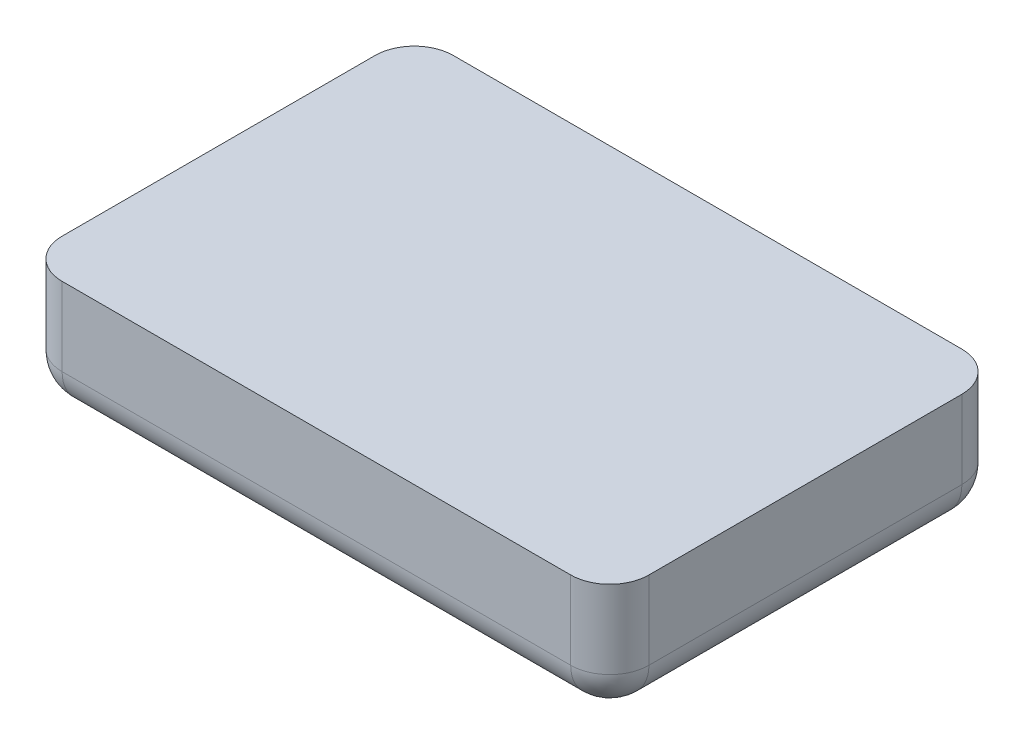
ISO-10303-21;
HEADER;
FILE_DESCRIPTION(('STEP AP214'),'2;1');
FILE_NAME('part.step','',(''),(''),'','','');
FILE_SCHEMA(('AUTOMOTIVE_DESIGN { 1 0 10303 214 1 1 1 1 }'));
ENDSEC;
DATA;
#1=APPLICATION_CONTEXT('core data for automotive mechanical design processes');
#2=APPLICATION_PROTOCOL_DEFINITION('international standard','automotive_design',2000,#1);
#3=PRODUCT_CONTEXT('',#1,'mechanical');
#4=PRODUCT('Part','Part','',(#3));
#5=PRODUCT_RELATED_PRODUCT_CATEGORY('part','',(#4));
#6=PRODUCT_DEFINITION_FORMATION('','',#4);
#7=PRODUCT_DEFINITION_CONTEXT('part definition',#1,'design');
#8=PRODUCT_DEFINITION('design','',#6,#7);
#9=PRODUCT_DEFINITION_SHAPE('','',#8);
#10=(LENGTH_UNIT() NAMED_UNIT(*) SI_UNIT(.MILLI.,.METRE.));
#11=(NAMED_UNIT(*) PLANE_ANGLE_UNIT() SI_UNIT($,.RADIAN.));
#12=(NAMED_UNIT(*) SI_UNIT($,.STERADIAN.) SOLID_ANGLE_UNIT());
#13=UNCERTAINTY_MEASURE_WITH_UNIT(LENGTH_MEASURE(1.E-05),#10,'distance_accuracy_value','');
#14=(GEOMETRIC_REPRESENTATION_CONTEXT(3) GLOBAL_UNCERTAINTY_ASSIGNED_CONTEXT((#13)) GLOBAL_UNIT_ASSIGNED_CONTEXT((#10,
#11,#12)) REPRESENTATION_CONTEXT('',''));
#15=CARTESIAN_POINT('',(0.,0.,0.));
#16=DIRECTION('',(0.,0.,1.));
#17=DIRECTION('',(1.,0.,0.));
#18=AXIS2_PLACEMENT_3D('',#15,#16,#17);
#19=CARTESIAN_POINT('',(-75.,30.,-50.));
#20=DIRECTION('',(1.,0.,0.));
#21=DIRECTION('',(0.,0.,-1.));
#22=AXIS2_PLACEMENT_3D('',#19,#20,#21);
#23=PLANE('',#22);
#24=DIRECTION('',(0.,0.,1.));
#25=VECTOR('',#24,1.);
#26=CARTESIAN_POINT('',(-75.,30.,-50.));
#27=LINE('',#26,#25);
#28=CARTESIAN_POINT('',(-75.,30.,-40.));
#29=VERTEX_POINT('',#28);
#30=CARTESIAN_POINT('',(-75.,30.,40.));
#31=VERTEX_POINT('',#30);
#32=EDGE_CURVE('E118',#29,#31,#27,.T.);
#33=ORIENTED_EDGE('',*,*,#32,.F.);
#34=DIRECTION('',(0.,-1.,0.));
#35=VECTOR('',#34,1.);
#36=CARTESIAN_POINT('',(-75.,30.,-40.));
#37=LINE('',#36,#35);
#38=CARTESIAN_POINT('',(-75.,10.,-40.));
#39=VERTEX_POINT('',#38);
#40=EDGE_CURVE('E51',#29,#39,#37,.T.);
#41=ORIENTED_EDGE('',*,*,#40,.T.);
#42=DIRECTION('',(0.,0.,1.));
#43=VECTOR('',#42,1.);
#44=CARTESIAN_POINT('',(-75.,10.,-50.));
#45=LINE('',#44,#43);
#46=CARTESIAN_POINT('',(-75.,10.,40.));
#47=VERTEX_POINT('',#46);
#48=EDGE_CURVE('E56',#39,#47,#45,.T.);
#49=ORIENTED_EDGE('',*,*,#48,.T.);
#50=DIRECTION('',(0.,-1.,0.));
#51=VECTOR('',#50,1.);
#52=CARTESIAN_POINT('',(-75.,30.,40.));
#53=LINE('',#52,#51);
#54=EDGE_CURVE('E162',#47,#31,#53,.F.);
#55=ORIENTED_EDGE('',*,*,#54,.T.);
#56=EDGE_LOOP('',(#33,#41,#49,#55));
#57=FACE_BOUND('',#56,.T.);
#58=ADVANCED_FACE('F34',(#57),#23,.F.);
#59=CARTESIAN_POINT('',(-75.,30.,50.));
#60=DIRECTION('',(0.,0.,-1.));
#61=DIRECTION('',(-1.,0.,0.));
#62=AXIS2_PLACEMENT_3D('',#59,#60,#61);
#63=PLANE('',#62);
#64=DIRECTION('',(1.,0.,0.));
#65=VECTOR('',#64,1.);
#66=CARTESIAN_POINT('',(-75.,30.,50.));
#67=LINE('',#66,#65);
#68=CARTESIAN_POINT('',(-65.,30.,50.));
#69=VERTEX_POINT('',#68);
#70=CARTESIAN_POINT('',(65.,30.,50.));
#71=VERTEX_POINT('',#70);
#72=EDGE_CURVE('E116',#69,#71,#67,.T.);
#73=ORIENTED_EDGE('',*,*,#72,.F.);
#74=DIRECTION('',(0.,-1.,0.));
#75=VECTOR('',#74,1.);
#76=CARTESIAN_POINT('',(-65.,30.,50.));
#77=LINE('',#76,#75);
#78=CARTESIAN_POINT('',(-65.,10.,50.));
#79=VERTEX_POINT('',#78);
#80=EDGE_CURVE('E126',#69,#79,#77,.T.);
#81=ORIENTED_EDGE('',*,*,#80,.T.);
#82=DIRECTION('',(1.,0.,0.));
#83=VECTOR('',#82,1.);
#84=CARTESIAN_POINT('',(-75.,10.,50.));
#85=LINE('',#84,#83);
#86=CARTESIAN_POINT('',(65.,10.,50.));
#87=VERTEX_POINT('',#86);
#88=EDGE_CURVE('E137',#79,#87,#85,.T.);
#89=ORIENTED_EDGE('',*,*,#88,.T.);
#90=DIRECTION('',(0.,-1.,0.));
#91=VECTOR('',#90,1.);
#92=CARTESIAN_POINT('',(65.,30.,50.));
#93=LINE('',#92,#91);
#94=EDGE_CURVE('E129',#87,#71,#93,.F.);
#95=ORIENTED_EDGE('',*,*,#94,.T.);
#96=EDGE_LOOP('',(#73,#81,#89,#95));
#97=FACE_BOUND('',#96,.T.);
#98=ADVANCED_FACE('F124',(#97),#63,.F.);
#99=CARTESIAN_POINT('',(75.,30.,-50.));
#100=DIRECTION('',(-1.,0.,0.));
#101=DIRECTION('',(0.,0.,1.));
#102=AXIS2_PLACEMENT_3D('',#99,#100,#101);
#103=PLANE('',#102);
#104=DIRECTION('',(0.,0.,-1.));
#105=VECTOR('',#104,1.);
#106=CARTESIAN_POINT('',(75.,10.,-50.));
#107=LINE('',#106,#105);
#108=CARTESIAN_POINT('',(75.,10.,40.));
#109=VERTEX_POINT('',#108);
#110=CARTESIAN_POINT('',(75.,10.,-40.));
#111=VERTEX_POINT('',#110);
#112=EDGE_CURVE('E152',#109,#111,#107,.T.);
#113=ORIENTED_EDGE('',*,*,#112,.T.);
#114=DIRECTION('',(0.,-1.,0.));
#115=VECTOR('',#114,1.);
#116=CARTESIAN_POINT('',(75.,30.,-40.));
#117=LINE('',#116,#115);
#118=CARTESIAN_POINT('',(75.,30.,-40.));
#119=VERTEX_POINT('',#118);
#120=EDGE_CURVE('E154',#111,#119,#117,.F.);
#121=ORIENTED_EDGE('',*,*,#120,.T.);
#122=DIRECTION('',(0.,0.,-1.));
#123=VECTOR('',#122,1.);
#124=CARTESIAN_POINT('',(75.,30.,-50.));
#125=LINE('',#124,#123);
#126=CARTESIAN_POINT('',(75.,30.,40.));
#127=VERTEX_POINT('',#126);
#128=EDGE_CURVE('E130',#127,#119,#125,.T.);
#129=ORIENTED_EDGE('',*,*,#128,.F.);
#130=DIRECTION('',(0.,-1.,0.));
#131=VECTOR('',#130,1.);
#132=CARTESIAN_POINT('',(75.,30.,40.));
#133=LINE('',#132,#131);
#134=EDGE_CURVE('E150',#127,#109,#133,.T.);
#135=ORIENTED_EDGE('',*,*,#134,.T.);
#136=EDGE_LOOP('',(#113,#121,#129,#135));
#137=FACE_BOUND('',#136,.T.);
#138=ADVANCED_FACE('F233',(#137),#103,.F.);
#139=CARTESIAN_POINT('',(-75.,30.,-50.));
#140=DIRECTION('',(0.,0.,1.));
#141=DIRECTION('',(1.,0.,0.));
#142=AXIS2_PLACEMENT_3D('',#139,#140,#141);
#143=PLANE('',#142);
#144=DIRECTION('',(-1.,0.,0.));
#145=VECTOR('',#144,1.);
#146=CARTESIAN_POINT('',(-75.,10.,-50.));
#147=LINE('',#146,#145);
#148=CARTESIAN_POINT('',(65.,10.,-50.));
#149=VERTEX_POINT('',#148);
#150=CARTESIAN_POINT('',(-65.,10.,-50.));
#151=VERTEX_POINT('',#150);
#152=EDGE_CURVE('E158',#149,#151,#147,.T.);
#153=ORIENTED_EDGE('',*,*,#152,.T.);
#154=DIRECTION('',(0.,-1.,0.));
#155=VECTOR('',#154,1.);
#156=CARTESIAN_POINT('',(-65.,30.,-50.));
#157=LINE('',#156,#155);
#158=CARTESIAN_POINT('',(-65.,30.,-50.));
#159=VERTEX_POINT('',#158);
#160=EDGE_CURVE('E160',#151,#159,#157,.F.);
#161=ORIENTED_EDGE('',*,*,#160,.T.);
#162=DIRECTION('',(-1.,0.,0.));
#163=VECTOR('',#162,1.);
#164=CARTESIAN_POINT('',(-75.,30.,-50.));
#165=LINE('',#164,#163);
#166=CARTESIAN_POINT('',(65.,30.,-50.));
#167=VERTEX_POINT('',#166);
#168=EDGE_CURVE('E204',#167,#159,#165,.T.);
#169=ORIENTED_EDGE('',*,*,#168,.F.);
#170=DIRECTION('',(0.,-1.,0.));
#171=VECTOR('',#170,1.);
#172=CARTESIAN_POINT('',(65.,30.,-50.));
#173=LINE('',#172,#171);
#174=EDGE_CURVE('E156',#167,#149,#173,.T.);
#175=ORIENTED_EDGE('',*,*,#174,.T.);
#176=EDGE_LOOP('',(#153,#161,#169,#175));
#177=FACE_BOUND('',#176,.T.);
#178=ADVANCED_FACE('F252',(#177),#143,.F.);
#179=CARTESIAN_POINT('',(-75.,30.,50.));
#180=DIRECTION('',(0.,1.,0.));
#181=DIRECTION('',(0.,0.,1.));
#182=AXIS2_PLACEMENT_3D('',#179,#180,#181);
#183=PLANE('',#182);
#184=ORIENTED_EDGE('',*,*,#168,.T.);
#185=CARTESIAN_POINT('',(-65.,30.,-40.));
#186=DIRECTION('',(0.,1.,0.));
#187=DIRECTION('',(0.,0.,1.));
#188=AXIS2_PLACEMENT_3D('',#185,#186,#187);
#189=CIRCLE('',#188,10.);
#190=EDGE_CURVE('E11',#159,#29,#189,.T.);
#191=ORIENTED_EDGE('',*,*,#190,.T.);
#192=ORIENTED_EDGE('',*,*,#32,.T.);
#193=CARTESIAN_POINT('',(-65.,30.,40.));
#194=DIRECTION('',(0.,1.,0.));
#195=DIRECTION('',(0.,0.,1.));
#196=AXIS2_PLACEMENT_3D('',#193,#194,#195);
#197=CIRCLE('',#196,10.);
#198=EDGE_CURVE('E43',#31,#69,#197,.T.);
#199=ORIENTED_EDGE('',*,*,#198,.T.);
#200=ORIENTED_EDGE('',*,*,#72,.T.);
#201=CARTESIAN_POINT('',(65.,30.,40.));
#202=DIRECTION('',(0.,1.,0.));
#203=DIRECTION('',(0.,0.,1.));
#204=AXIS2_PLACEMENT_3D('',#201,#202,#203);
#205=CIRCLE('',#204,10.);
#206=EDGE_CURVE('E166',#71,#127,#205,.T.);
#207=ORIENTED_EDGE('',*,*,#206,.T.);
#208=ORIENTED_EDGE('',*,*,#128,.T.);
#209=CARTESIAN_POINT('',(65.,30.,-40.));
#210=DIRECTION('',(0.,1.,0.));
#211=DIRECTION('',(0.,0.,1.));
#212=AXIS2_PLACEMENT_3D('',#209,#210,#211);
#213=CIRCLE('',#212,10.);
#214=EDGE_CURVE('E121',#119,#167,#213,.T.);
#215=ORIENTED_EDGE('',*,*,#214,.T.);
#216=EDGE_LOOP('',(#184,#191,#192,#199,#200,#207,#208,#215));
#217=FACE_BOUND('',#216,.T.);
#218=ADVANCED_FACE('F115',(#217),#183,.T.);
#219=CARTESIAN_POINT('',(-75.,0.,50.));
#220=DIRECTION('',(0.,1.,0.));
#221=DIRECTION('',(0.,0.,1.));
#222=AXIS2_PLACEMENT_3D('',#219,#220,#221);
#223=PLANE('',#222);
#224=DIRECTION('',(0.,0.,-1.));
#225=VECTOR('',#224,1.);
#226=CARTESIAN_POINT('',(65.,0.,50.));
#227=LINE('',#226,#225);
#228=CARTESIAN_POINT('',(65.,0.,-40.));
#229=VERTEX_POINT('',#228);
#230=CARTESIAN_POINT('',(65.,0.,40.));
#231=VERTEX_POINT('',#230);
#232=EDGE_CURVE('E145',#229,#231,#227,.F.);
#233=ORIENTED_EDGE('',*,*,#232,.T.);
#234=DIRECTION('',(1.,0.,0.));
#235=VECTOR('',#234,1.);
#236=CARTESIAN_POINT('',(-75.,0.,40.));
#237=LINE('',#236,#235);
#238=CARTESIAN_POINT('',(-65.,0.,40.));
#239=VERTEX_POINT('',#238);
#240=EDGE_CURVE('E147',#231,#239,#237,.F.);
#241=ORIENTED_EDGE('',*,*,#240,.T.);
#242=DIRECTION('',(0.,0.,1.));
#243=VECTOR('',#242,1.);
#244=CARTESIAN_POINT('',(-65.,0.,50.));
#245=LINE('',#244,#243);
#246=CARTESIAN_POINT('',(-65.,0.,-40.));
#247=VERTEX_POINT('',#246);
#248=EDGE_CURVE('E136',#239,#247,#245,.F.);
#249=ORIENTED_EDGE('',*,*,#248,.T.);
#250=DIRECTION('',(-1.,0.,0.));
#251=VECTOR('',#250,1.);
#252=CARTESIAN_POINT('',(-75.,0.,-40.));
#253=LINE('',#252,#251);
#254=EDGE_CURVE('E139',#247,#229,#253,.F.);
#255=ORIENTED_EDGE('',*,*,#254,.T.);
#256=EDGE_LOOP('',(#233,#241,#249,#255));
#257=FACE_BOUND('',#256,.T.);
#258=ADVANCED_FACE('F247',(#257),#223,.F.);
#259=CARTESIAN_POINT('',(-65.,30.,-40.));
#260=DIRECTION('',(0.,-1.,0.));
#261=DIRECTION('',(0.,0.,-1.));
#262=AXIS2_PLACEMENT_3D('',#259,#260,#261);
#263=CYLINDRICAL_SURFACE('',#262,10.);
#264=ORIENTED_EDGE('',*,*,#190,.F.);
#265=ORIENTED_EDGE('',*,*,#160,.F.);
#266=CARTESIAN_POINT('',(-65.,10.,-40.));
#267=DIRECTION('',(0.,-1.,0.));
#268=DIRECTION('',(0.,0.,-1.));
#269=AXIS2_PLACEMENT_3D('',#266,#267,#268);
#270=CIRCLE('',#269,10.);
#271=EDGE_CURVE('E194',#39,#151,#270,.T.);
#272=ORIENTED_EDGE('',*,*,#271,.F.);
#273=ORIENTED_EDGE('',*,*,#40,.F.);
#274=EDGE_LOOP('',(#264,#265,#272,#273));
#275=FACE_BOUND('',#274,.T.);
#276=ADVANCED_FACE('F36',(#275),#263,.T.);
#277=CARTESIAN_POINT('',(65.,30.,-40.));
#278=DIRECTION('',(0.,-1.,0.));
#279=DIRECTION('',(0.,0.,-1.));
#280=AXIS2_PLACEMENT_3D('',#277,#278,#279);
#281=CYLINDRICAL_SURFACE('',#280,10.);
#282=ORIENTED_EDGE('',*,*,#214,.F.);
#283=ORIENTED_EDGE('',*,*,#120,.F.);
#284=CARTESIAN_POINT('',(65.,10.,-40.));
#285=DIRECTION('',(0.,-1.,0.));
#286=DIRECTION('',(0.,0.,-1.));
#287=AXIS2_PLACEMENT_3D('',#284,#285,#286);
#288=CIRCLE('',#287,10.);
#289=EDGE_CURVE('E192',#149,#111,#288,.T.);
#290=ORIENTED_EDGE('',*,*,#289,.F.);
#291=ORIENTED_EDGE('',*,*,#174,.F.);
#292=EDGE_LOOP('',(#282,#283,#290,#291));
#293=FACE_BOUND('',#292,.T.);
#294=ADVANCED_FACE('F238',(#293),#281,.T.);
#295=CARTESIAN_POINT('',(-75.,10.,-40.));
#296=DIRECTION('',(-1.,0.,0.));
#297=DIRECTION('',(0.,0.,1.));
#298=AXIS2_PLACEMENT_3D('',#295,#296,#297);
#299=CYLINDRICAL_SURFACE('',#298,10.);
#300=CARTESIAN_POINT('',(-65.,10.,-40.));
#301=DIRECTION('',(-1.,0.,0.));
#302=DIRECTION('',(0.,0.,1.));
#303=AXIS2_PLACEMENT_3D('',#300,#301,#302);
#304=CIRCLE('',#303,10.);
#305=EDGE_CURVE('E38',#151,#247,#304,.T.);
#306=ORIENTED_EDGE('',*,*,#305,.F.);
#307=ORIENTED_EDGE('',*,*,#152,.F.);
#308=CARTESIAN_POINT('',(65.,10.,-40.));
#309=DIRECTION('',(1.,0.,0.));
#310=DIRECTION('',(0.,0.,-1.));
#311=AXIS2_PLACEMENT_3D('',#308,#309,#310);
#312=CIRCLE('',#311,10.);
#313=EDGE_CURVE('E189',#229,#149,#312,.T.);
#314=ORIENTED_EDGE('',*,*,#313,.F.);
#315=ORIENTED_EDGE('',*,*,#254,.F.);
#316=EDGE_LOOP('',(#306,#307,#314,#315));
#317=FACE_BOUND('',#316,.T.);
#318=ADVANCED_FACE('F251',(#317),#299,.T.);
#319=CARTESIAN_POINT('',(-65.,10.,-40.));
#320=DIRECTION('',(0.,0.,1.));
#321=DIRECTION('',(1.,0.,0.));
#322=AXIS2_PLACEMENT_3D('',#319,#320,#321);
#323=SPHERICAL_SURFACE('',#322,10.);
#324=ORIENTED_EDGE('',*,*,#271,.T.);
#325=ORIENTED_EDGE('',*,*,#305,.T.);
#326=CARTESIAN_POINT('',(-65.,10.,-40.));
#327=DIRECTION('',(0.,0.,-1.));
#328=DIRECTION('',(-1.,0.,0.));
#329=AXIS2_PLACEMENT_3D('',#326,#327,#328);
#330=CIRCLE('',#329,10.);
#331=EDGE_CURVE('E186',#39,#247,#330,.F.);
#332=ORIENTED_EDGE('',*,*,#331,.F.);
#333=EDGE_LOOP('',(#324,#325,#332));
#334=FACE_BOUND('',#333,.T.);
#335=ADVANCED_FACE('F212',(#334),#323,.T.);
#336=CARTESIAN_POINT('',(65.,10.,-40.));
#337=DIRECTION('',(0.,0.,1.));
#338=DIRECTION('',(1.,0.,0.));
#339=AXIS2_PLACEMENT_3D('',#336,#337,#338);
#340=SPHERICAL_SURFACE('',#339,10.);
#341=ORIENTED_EDGE('',*,*,#313,.T.);
#342=ORIENTED_EDGE('',*,*,#289,.T.);
#343=CARTESIAN_POINT('',(65.,10.,-40.));
#344=DIRECTION('',(0.,0.,-1.));
#345=DIRECTION('',(-1.,0.,0.));
#346=AXIS2_PLACEMENT_3D('',#343,#344,#345);
#347=CIRCLE('',#346,10.);
#348=EDGE_CURVE('E183',#229,#111,#347,.F.);
#349=ORIENTED_EDGE('',*,*,#348,.F.);
#350=EDGE_LOOP('',(#341,#342,#349));
#351=FACE_BOUND('',#350,.T.);
#352=ADVANCED_FACE('F241',(#351),#340,.T.);
#353=CARTESIAN_POINT('',(-65.,10.,-50.));
#354=DIRECTION('',(0.,0.,1.));
#355=DIRECTION('',(1.,0.,0.));
#356=AXIS2_PLACEMENT_3D('',#353,#354,#355);
#357=CYLINDRICAL_SURFACE('',#356,10.);
#358=ORIENTED_EDGE('',*,*,#331,.T.);
#359=ORIENTED_EDGE('',*,*,#248,.F.);
#360=CARTESIAN_POINT('',(-65.,10.,40.));
#361=DIRECTION('',(0.,0.,1.));
#362=DIRECTION('',(1.,0.,0.));
#363=AXIS2_PLACEMENT_3D('',#360,#361,#362);
#364=CIRCLE('',#363,10.);
#365=EDGE_CURVE('E180',#47,#239,#364,.T.);
#366=ORIENTED_EDGE('',*,*,#365,.F.);
#367=ORIENTED_EDGE('',*,*,#48,.F.);
#368=EDGE_LOOP('',(#358,#359,#366,#367));
#369=FACE_BOUND('',#368,.T.);
#370=ADVANCED_FACE('F216',(#369),#357,.T.);
#371=CARTESIAN_POINT('',(-65.,30.,40.));
#372=DIRECTION('',(0.,-1.,0.));
#373=DIRECTION('',(0.,0.,-1.));
#374=AXIS2_PLACEMENT_3D('',#371,#372,#373);
#375=CYLINDRICAL_SURFACE('',#374,10.);
#376=ORIENTED_EDGE('',*,*,#198,.F.);
#377=ORIENTED_EDGE('',*,*,#54,.F.);
#378=CARTESIAN_POINT('',(-65.,10.,40.));
#379=DIRECTION('',(0.,-1.,0.));
#380=DIRECTION('',(0.,0.,-1.));
#381=AXIS2_PLACEMENT_3D('',#378,#379,#380);
#382=CIRCLE('',#381,10.);
#383=EDGE_CURVE('E134',#79,#47,#382,.T.);
#384=ORIENTED_EDGE('',*,*,#383,.F.);
#385=ORIENTED_EDGE('',*,*,#80,.F.);
#386=EDGE_LOOP('',(#376,#377,#384,#385));
#387=FACE_BOUND('',#386,.T.);
#388=ADVANCED_FACE('F132',(#387),#375,.T.);
#389=CARTESIAN_POINT('',(65.,30.,40.));
#390=DIRECTION('',(0.,-1.,0.));
#391=DIRECTION('',(0.,0.,-1.));
#392=AXIS2_PLACEMENT_3D('',#389,#390,#391);
#393=CYLINDRICAL_SURFACE('',#392,10.);
#394=ORIENTED_EDGE('',*,*,#206,.F.);
#395=ORIENTED_EDGE('',*,*,#94,.F.);
#396=CARTESIAN_POINT('',(65.,10.,40.));
#397=DIRECTION('',(0.,-1.,0.));
#398=DIRECTION('',(0.,0.,-1.));
#399=AXIS2_PLACEMENT_3D('',#396,#397,#398);
#400=CIRCLE('',#399,10.);
#401=EDGE_CURVE('E176',#109,#87,#400,.T.);
#402=ORIENTED_EDGE('',*,*,#401,.F.);
#403=ORIENTED_EDGE('',*,*,#134,.F.);
#404=EDGE_LOOP('',(#394,#395,#402,#403));
#405=FACE_BOUND('',#404,.T.);
#406=ADVANCED_FACE('F230',(#405),#393,.T.);
#407=CARTESIAN_POINT('',(65.,10.,-50.));
#408=DIRECTION('',(0.,0.,-1.));
#409=DIRECTION('',(-1.,0.,0.));
#410=AXIS2_PLACEMENT_3D('',#407,#408,#409);
#411=CYLINDRICAL_SURFACE('',#410,10.);
#412=ORIENTED_EDGE('',*,*,#348,.T.);
#413=ORIENTED_EDGE('',*,*,#112,.F.);
#414=CARTESIAN_POINT('',(65.,10.,40.));
#415=DIRECTION('',(0.,0.,1.));
#416=DIRECTION('',(1.,0.,0.));
#417=AXIS2_PLACEMENT_3D('',#414,#415,#416);
#418=CIRCLE('',#417,10.);
#419=EDGE_CURVE('E173',#231,#109,#418,.T.);
#420=ORIENTED_EDGE('',*,*,#419,.F.);
#421=ORIENTED_EDGE('',*,*,#232,.F.);
#422=EDGE_LOOP('',(#412,#413,#420,#421));
#423=FACE_BOUND('',#422,.T.);
#424=ADVANCED_FACE('F245',(#423),#411,.T.);
#425=CARTESIAN_POINT('',(-65.,10.,40.));
#426=DIRECTION('',(0.,0.,1.));
#427=DIRECTION('',(1.,0.,0.));
#428=AXIS2_PLACEMENT_3D('',#425,#426,#427);
#429=SPHERICAL_SURFACE('',#428,10.);
#430=ORIENTED_EDGE('',*,*,#383,.T.);
#431=ORIENTED_EDGE('',*,*,#365,.T.);
#432=CARTESIAN_POINT('',(-65.,10.,40.));
#433=DIRECTION('',(-1.,0.,0.));
#434=DIRECTION('',(0.,0.,1.));
#435=AXIS2_PLACEMENT_3D('',#432,#433,#434);
#436=CIRCLE('',#435,10.);
#437=EDGE_CURVE('E171',#79,#239,#436,.F.);
#438=ORIENTED_EDGE('',*,*,#437,.F.);
#439=EDGE_LOOP('',(#430,#431,#438));
#440=FACE_BOUND('',#439,.T.);
#441=ADVANCED_FACE('F218',(#440),#429,.T.);
#442=CARTESIAN_POINT('',(65.,10.,40.));
#443=DIRECTION('',(0.,0.,1.));
#444=DIRECTION('',(1.,0.,0.));
#445=AXIS2_PLACEMENT_3D('',#442,#443,#444);
#446=SPHERICAL_SURFACE('',#445,10.);
#447=ORIENTED_EDGE('',*,*,#419,.T.);
#448=ORIENTED_EDGE('',*,*,#401,.T.);
#449=CARTESIAN_POINT('',(65.,10.,40.));
#450=DIRECTION('',(1.,0.,0.));
#451=DIRECTION('',(0.,0.,-1.));
#452=AXIS2_PLACEMENT_3D('',#449,#450,#451);
#453=CIRCLE('',#452,10.);
#454=EDGE_CURVE('E169',#231,#87,#453,.F.);
#455=ORIENTED_EDGE('',*,*,#454,.F.);
#456=EDGE_LOOP('',(#447,#448,#455));
#457=FACE_BOUND('',#456,.T.);
#458=ADVANCED_FACE('F226',(#457),#446,.T.);
#459=CARTESIAN_POINT('',(-75.,10.,40.));
#460=DIRECTION('',(1.,0.,0.));
#461=DIRECTION('',(0.,0.,-1.));
#462=AXIS2_PLACEMENT_3D('',#459,#460,#461);
#463=CYLINDRICAL_SURFACE('',#462,10.);
#464=ORIENTED_EDGE('',*,*,#437,.T.);
#465=ORIENTED_EDGE('',*,*,#240,.F.);
#466=ORIENTED_EDGE('',*,*,#454,.T.);
#467=ORIENTED_EDGE('',*,*,#88,.F.);
#468=EDGE_LOOP('',(#464,#465,#466,#467));
#469=FACE_BOUND('',#468,.T.);
#470=ADVANCED_FACE('F222',(#469),#463,.T.);
#471=CLOSED_SHELL('',(#58,#98,#138,#178,#218,#258,#276,#294,#318,#335,#352,#370,#388,#406,#424,
#441,#458,#470));
#472=MANIFOLD_SOLID_BREP('B2',#471);
#473=ADVANCED_BREP_SHAPE_REPRESENTATION('',(#18,#472),#14);
#474=SHAPE_DEFINITION_REPRESENTATION(#9,#473);
ENDSEC;
END-ISO-10303-21;
